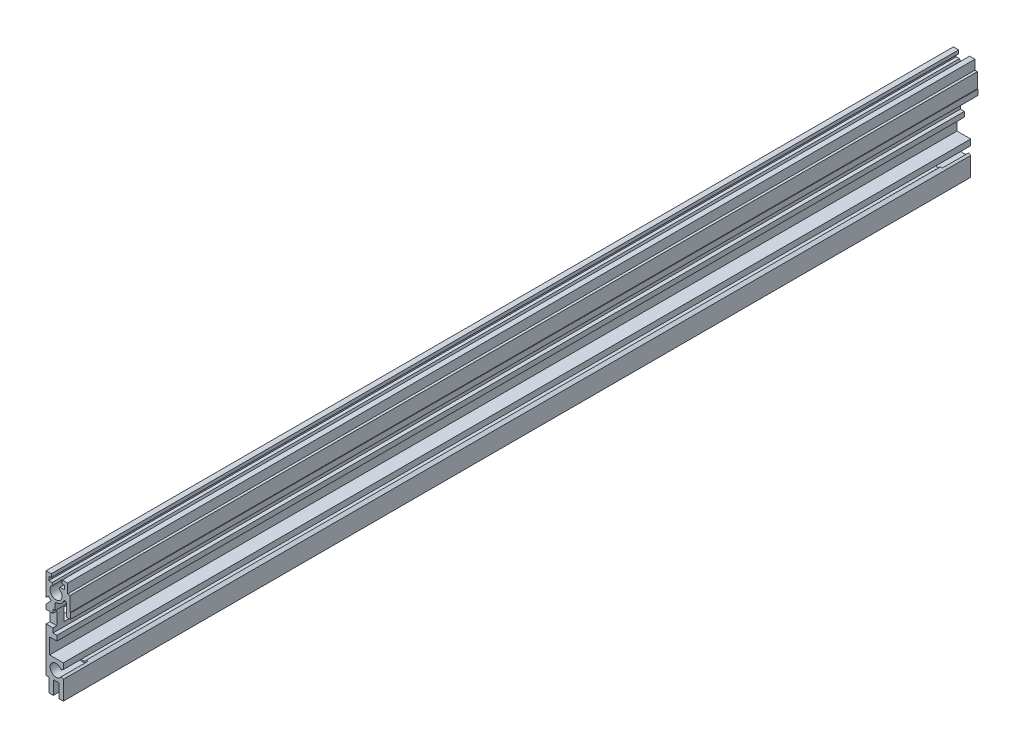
from build123d import *

# Parameters (mm, degrees)
EXTRUDE_1_DEPTH        = 325.12
CUT_EXTRUDE_1_REACH    = 328.48
SKETCH_2_W             = 7.5
SKETCH_2_H             = 4.5
PATTERN_LINEAR_1_COUNT = 32
PATTERN_LINEAR_1_PITCH = 10.16
SKETCH_3_R             = 2.15
CUT_EXTRUDE_2_DEPTH    = 9.5
CUT_EXTRUDE_START      = -9.5
SKETCH_4_R             = 2.15
CUT_EXTRUDE_3_DEPTH    = 9.5
SKETCH_5_W             = 1.36
SKETCH_5_H             = 4.5
CUT_EXTRUDE_4_DEPTH    = 10


with BuildPart() as part:
    # Sketch 1 → Extrude 1 (new body)
    with BuildSketch(Plane.XY):
        with BuildLine():
            Line((-2.5, -8.3), (-1, -8.3))
            Line((-1, -8.3), (-1, -3.4))
            Line((-1, -3.4), (1.1, -3.4))
            Line((1.1, -3.4), (1.1, -8.3))
            Line((1.1, -8.3), (2.6, -8.3))
            Line((2.6, -8.3), (2.6, -1.5011107))
            Line((2.6, -1.5011107), (1.428941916, -0.825))
            ThreePointArc((1.428941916, -0.825), (-1.65, 0), (1.428941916, 0.825))
            Line((1.428941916, 0.825), (2.6, 1.5011107))
            Line((2.6, 1.5011107), (2.6, 3.6))
            Line((2.6, 3.6), (-2.3, 3.6))
            Line((-2.3, 3.6), (-2.3, 9.2))
            Line((-2.3, 9.2), (0.3, 9.2))
            Line((0.3, 9.2), (0.3, 11))
            Line((0.3, 11), (-1.1, 11))
            Line((-1.1, 11), (-1.1, 18.4))
            Line((-1.1, 18.4), (-0.3, 18.4))
            Line((-0.3, 18.4), (-0.3, 20.55580198))
            ThreePointArc((-0.3, 20.55580198), (-0.163656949, 20.898954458), (0.171014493, 21.054961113))
            ThreePointArc((0.171014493, 21.054961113), (1.720972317, 21.604012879), (2.736231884, 22.897486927))
            ThreePointArc((2.736231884, 22.897486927), (3.295173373, 23.201478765), (3.7, 22.710620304))
            Line((3.7, 22.710620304), (3.7, 18.4))
            Line((3.7, 18.4), (5.2, 18.4))
            Line((5.2, 18.4), (5.2, 20.4))
            Line((5.2, 20.4), (5, 20.4))
            Line((5, 20.4), (5, 25.7))
            Line((5, 25.7), (4.1, 25.7))
            Line((4.1, 25.7), (4.1, 29.1))
            Line((4.1, 29.1), (2.2, 29.1))
            Line((2.2, 29.1), (2.2, 27.9))
            Line((2.2, 27.9), (3.1, 27.9))
            Line((3.1, 27.9), (3.1, 26.5))
            Line((3.1, 26.5), (1.443375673, 26.5))
            Line((1.443375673, 26.5), (0.825, 25.428941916))
            ThreePointArc((0.825, 25.428941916), (0, 22.35), (-0.825, 25.428941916))
            Line((-0.825, 25.428941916), (-1.443375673, 26.5))
            Line((-1.443375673, 26.5), (-2.6, 26.5))
            Line((-2.6, 26.5), (-2.6, 27.9))
            Line((-2.6, 27.9), (-1.7, 27.9))
            Line((-1.7, 27.9), (-1.7, 29.1))
            Line((-1.7, 29.1), (-3.6, 29.1))
            Line((-3.6, 29.1), (-3.6, 20.792785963))
            Line((-3.6, 20.792785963), (-2.840611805, 21.636550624))
            Line((-2.840611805, 21.636550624), (-1.8, 20.7))
            Line((-1.8, 20.7), (-3.6, 18.7))
            Line((-3.6, 18.7), (-3.6, -3.4))
            Line((-3.6, -3.4), (-2.5, -3.4))
            Line((-2.5, -3.4), (-2.5, -8.3))
        make_face()
    extrude(amount=-EXTRUDE_1_DEPTH)

    # Sketch 2 → Cut-Extrude 1 (cut, up to next)
    with BuildSketch(Plane(origin=(-1.1, 0, 0), x_dir=(0, 0, -1), z_dir=(1, 0, 0)), mode=Mode.PRIVATE) as cut_extrude_1_sk1:
        with Locations((7.77, 14.85)):
            Rectangle(SKETCH_2_W, SKETCH_2_H)
    cut_extrude_1_tool1 = extrude(cut_extrude_1_sk1.sketch, amount=-CUT_EXTRUDE_1_REACH, mode=Mode.PRIVATE) & part.part
    cut_extrude_1 = cut_extrude_1_tool1.solids().sort_by_distance((-1.1, 14.85, -7.77))[0]
    add(cut_extrude_1, mode=Mode.SUBTRACT)

    # Pattern Linear 1: Cut-Extrude 1 ×32
    with Locations(*[(0, 0, -i * PATTERN_LINEAR_1_PITCH) for i in range(1, PATTERN_LINEAR_1_COUNT)]):
        add(cut_extrude_1, mode=Mode.SUBTRACT)

    # Sketch 3 → Cut-Extrude 2 (cut)
    with BuildSketch(Plane.XY):
        Circle(SKETCH_3_R)
        with Locations((0, 24)):
            Circle(SKETCH_3_R)
    extrude(amount=-CUT_EXTRUDE_2_DEPTH, mode=Mode.SUBTRACT)

    # Sketch 4 → Cut-Extrude 3 (cut)
    with BuildSketch(Plane(origin=(0, 0, -325.12), x_dir=(-1, 0, 0), z_dir=(0, 0, -1)).offset(CUT_EXTRUDE_START)):
        Circle(SKETCH_4_R)
        with Locations((0, 24)):
            Circle(SKETCH_4_R)
    extrude(amount=CUT_EXTRUDE_3_DEPTH, mode=Mode.SUBTRACT)

    # Sketch 5 → Cut-Extrude 4 (cut)
    with BuildSketch(Plane.ZY.offset(3.6)):
        with Locations((-0.68, 14.85)):
            Rectangle(SKETCH_5_W, SKETCH_5_H)
        with Locations((-324.44, 14.85)):
            Rectangle(SKETCH_5_W, SKETCH_5_H)
    extrude(amount=-CUT_EXTRUDE_4_DEPTH, mode=Mode.SUBTRACT)


solid = part.part
